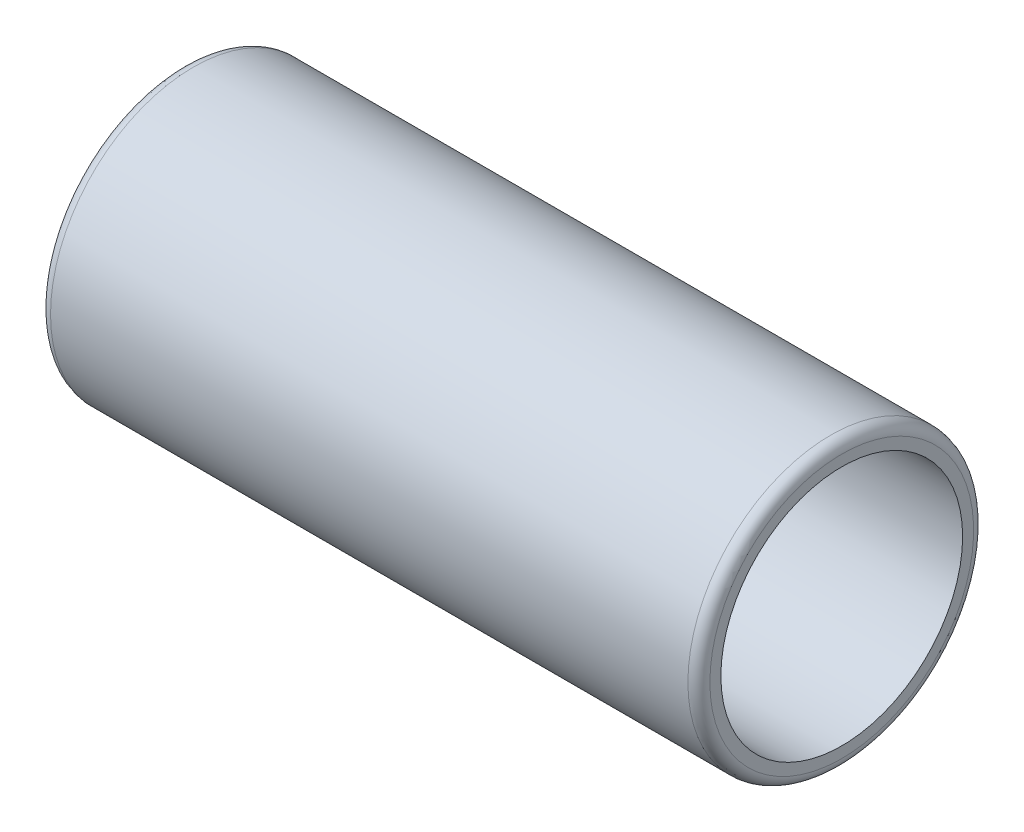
ISO-10303-21;
HEADER;
FILE_DESCRIPTION(('STEP AP214'),'2;1');
FILE_NAME('part.step','',(''),(''),'','','');
FILE_SCHEMA(('AUTOMOTIVE_DESIGN { 1 0 10303 214 1 1 1 1 }'));
ENDSEC;
DATA;
#1=APPLICATION_CONTEXT('core data for automotive mechanical design processes');
#2=APPLICATION_PROTOCOL_DEFINITION('international standard','automotive_design',2000,#1);
#3=PRODUCT_CONTEXT('',#1,'mechanical');
#4=PRODUCT('Part','Part','',(#3));
#5=PRODUCT_RELATED_PRODUCT_CATEGORY('part','',(#4));
#6=PRODUCT_DEFINITION_FORMATION('','',#4);
#7=PRODUCT_DEFINITION_CONTEXT('part definition',#1,'design');
#8=PRODUCT_DEFINITION('design','',#6,#7);
#9=PRODUCT_DEFINITION_SHAPE('','',#8);
#10=(LENGTH_UNIT() NAMED_UNIT(*) SI_UNIT(.MILLI.,.METRE.));
#11=(NAMED_UNIT(*) PLANE_ANGLE_UNIT() SI_UNIT($,.RADIAN.));
#12=(NAMED_UNIT(*) SI_UNIT($,.STERADIAN.) SOLID_ANGLE_UNIT());
#13=UNCERTAINTY_MEASURE_WITH_UNIT(LENGTH_MEASURE(1.E-05),#10,'distance_accuracy_value','');
#14=(GEOMETRIC_REPRESENTATION_CONTEXT(3) GLOBAL_UNCERTAINTY_ASSIGNED_CONTEXT((#13)) GLOBAL_UNIT_ASSIGNED_CONTEXT((#10,
#11,#12)) REPRESENTATION_CONTEXT('',''));
#15=CARTESIAN_POINT('',(0.,0.,0.));
#16=DIRECTION('',(0.,0.,1.));
#17=DIRECTION('',(1.,0.,0.));
#18=AXIS2_PLACEMENT_3D('',#15,#16,#17);
#19=CARTESIAN_POINT('',(0.,0.,0.));
#20=DIRECTION('',(-1.,0.,0.));
#21=DIRECTION('',(0.,0.,1.));
#22=AXIS2_PLACEMENT_3D('',#19,#20,#21);
#23=CYLINDRICAL_SURFACE('',#22,6.);
#24=CARTESIAN_POINT('',(8.,0.,0.));
#25=DIRECTION('',(-1.,0.,0.));
#26=DIRECTION('',(0.,0.,1.));
#27=AXIS2_PLACEMENT_3D('',#24,#25,#26);
#28=CIRCLE('',#27,6.);
#29=CARTESIAN_POINT('',(8.,0.,6.));
#30=VERTEX_POINT('',#29);
#31=EDGE_CURVE('E43',#30,#30,#28,.T.);
#32=ORIENTED_EDGE('',*,*,#31,.F.);
#33=EDGE_LOOP('',(#32));
#34=FACE_BOUND('',#33,.T.);
#35=CARTESIAN_POINT('',(0.,0.,0.));
#36=DIRECTION('',(-1.,0.,0.));
#37=DIRECTION('',(0.,0.,1.));
#38=AXIS2_PLACEMENT_3D('',#35,#36,#37);
#39=CIRCLE('',#38,6.);
#40=CARTESIAN_POINT('',(0.,0.,6.));
#41=VERTEX_POINT('',#40);
#42=EDGE_CURVE('E34',#41,#41,#39,.T.);
#43=ORIENTED_EDGE('',*,*,#42,.T.);
#44=EDGE_LOOP('',(#43));
#45=FACE_BOUND('',#44,.T.);
#46=ADVANCED_FACE('F14',(#34,#45),#23,.F.);
#47=CARTESIAN_POINT('',(0.,6.,0.));
#48=DIRECTION('',(1.,0.,0.));
#49=DIRECTION('',(0.,0.,-1.));
#50=AXIS2_PLACEMENT_3D('',#47,#48,#49);
#51=PLANE('',#50);
#52=CARTESIAN_POINT('',(0.,0.,0.));
#53=DIRECTION('',(1.,0.,0.));
#54=DIRECTION('',(0.,0.,-1.));
#55=AXIS2_PLACEMENT_3D('',#52,#53,#54);
#56=CIRCLE('',#55,12.);
#57=CARTESIAN_POINT('',(0.,0.,-12.));
#58=VERTEX_POINT('',#57);
#59=EDGE_CURVE('E21',#58,#58,#56,.F.);
#60=ORIENTED_EDGE('',*,*,#59,.T.);
#61=EDGE_LOOP('',(#60));
#62=FACE_BOUND('',#61,.T.);
#63=ORIENTED_EDGE('',*,*,#42,.F.);
#64=EDGE_LOOP('',(#63));
#65=FACE_BOUND('',#64,.T.);
#66=ADVANCED_FACE('F51',(#62,#65),#51,.F.);
#67=CARTESIAN_POINT('',(0.,0.,0.));
#68=DIRECTION('',(-1.,0.,0.));
#69=DIRECTION('',(0.,0.,1.));
#70=AXIS2_PLACEMENT_3D('',#67,#68,#69);
#71=CYLINDRICAL_SURFACE('',#70,13.);
#72=CARTESIAN_POINT('',(1.,0.,0.));
#73=DIRECTION('',(1.,0.,0.));
#74=DIRECTION('',(0.,0.,-1.));
#75=AXIS2_PLACEMENT_3D('',#72,#73,#74);
#76=CIRCLE('',#75,13.);
#77=CARTESIAN_POINT('',(1.,0.,-13.));
#78=VERTEX_POINT('',#77);
#79=EDGE_CURVE('E9',#78,#78,#76,.T.);
#80=ORIENTED_EDGE('',*,*,#79,.T.);
#81=EDGE_LOOP('',(#80));
#82=FACE_BOUND('',#81,.T.);
#83=CARTESIAN_POINT('',(59.,0.,0.));
#84=DIRECTION('',(-1.,0.,0.));
#85=DIRECTION('',(0.,0.,1.));
#86=AXIS2_PLACEMENT_3D('',#83,#84,#85);
#87=CIRCLE('',#86,13.);
#88=CARTESIAN_POINT('',(59.,0.,13.));
#89=VERTEX_POINT('',#88);
#90=EDGE_CURVE('E29',#89,#89,#87,.T.);
#91=ORIENTED_EDGE('',*,*,#90,.T.);
#92=EDGE_LOOP('',(#91));
#93=FACE_BOUND('',#92,.T.);
#94=ADVANCED_FACE('F56',(#82,#93),#71,.T.);
#95=CARTESIAN_POINT('',(60.,13.,0.));
#96=DIRECTION('',(-1.,0.,0.));
#97=DIRECTION('',(0.,0.,1.));
#98=AXIS2_PLACEMENT_3D('',#95,#96,#97);
#99=PLANE('',#98);
#100=CARTESIAN_POINT('',(60.,0.,0.));
#101=DIRECTION('',(-1.,0.,0.));
#102=DIRECTION('',(0.,0.,1.));
#103=AXIS2_PLACEMENT_3D('',#100,#101,#102);
#104=CIRCLE('',#103,12.);
#105=CARTESIAN_POINT('',(60.,0.,12.));
#106=VERTEX_POINT('',#105);
#107=EDGE_CURVE('E25',#106,#106,#104,.F.);
#108=ORIENTED_EDGE('',*,*,#107,.T.);
#109=EDGE_LOOP('',(#108));
#110=FACE_BOUND('',#109,.T.);
#111=CARTESIAN_POINT('',(60.,0.,0.));
#112=DIRECTION('',(-1.,0.,0.));
#113=DIRECTION('',(0.,0.,1.));
#114=AXIS2_PLACEMENT_3D('',#111,#112,#113);
#115=CIRCLE('',#114,11.);
#116=CARTESIAN_POINT('',(60.,0.,11.));
#117=VERTEX_POINT('',#116);
#118=EDGE_CURVE('E37',#117,#117,#115,.T.);
#119=ORIENTED_EDGE('',*,*,#118,.T.);
#120=EDGE_LOOP('',(#119));
#121=FACE_BOUND('',#120,.T.);
#122=ADVANCED_FACE('F63',(#110,#121),#99,.F.);
#123=CARTESIAN_POINT('',(0.,0.,0.));
#124=DIRECTION('',(-1.,0.,0.));
#125=DIRECTION('',(0.,0.,1.));
#126=AXIS2_PLACEMENT_3D('',#123,#124,#125);
#127=CYLINDRICAL_SURFACE('',#126,11.);
#128=ORIENTED_EDGE('',*,*,#118,.F.);
#129=EDGE_LOOP('',(#128));
#130=FACE_BOUND('',#129,.T.);
#131=CARTESIAN_POINT('',(13.,0.,0.));
#132=DIRECTION('',(-1.,0.,0.));
#133=DIRECTION('',(0.,0.,1.));
#134=AXIS2_PLACEMENT_3D('',#131,#132,#133);
#135=CIRCLE('',#134,11.);
#136=CARTESIAN_POINT('',(13.,0.,11.));
#137=VERTEX_POINT('',#136);
#138=EDGE_CURVE('E40',#137,#137,#135,.T.);
#139=ORIENTED_EDGE('',*,*,#138,.T.);
#140=EDGE_LOOP('',(#139));
#141=FACE_BOUND('',#140,.T.);
#142=ADVANCED_FACE('F75',(#130,#141),#127,.F.);
#143=CARTESIAN_POINT('',(8.,0.,0.));
#144=DIRECTION('',(1.,0.,0.));
#145=DIRECTION('',(0.,0.,-1.));
#146=AXIS2_PLACEMENT_3D('',#143,#144,#145);
#147=CONICAL_SURFACE('',#146,6.,0.785398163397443);
#148=ORIENTED_EDGE('',*,*,#138,.F.);
#149=EDGE_LOOP('',(#148));
#150=FACE_BOUND('',#149,.T.);
#151=ORIENTED_EDGE('',*,*,#31,.T.);
#152=EDGE_LOOP('',(#151));
#153=FACE_BOUND('',#152,.T.);
#154=ADVANCED_FACE('F47',(#150,#153),#147,.F.);
#155=CARTESIAN_POINT('',(59.,0.,0.));
#156=DIRECTION('',(-1.,0.,0.));
#157=DIRECTION('',(0.,0.,1.));
#158=AXIS2_PLACEMENT_3D('',#155,#156,#157);
#159=TOROIDAL_SURFACE('',#158,12.,1.);
#160=ORIENTED_EDGE('',*,*,#107,.F.);
#161=EDGE_LOOP('',(#160));
#162=FACE_BOUND('',#161,.T.);
#163=ORIENTED_EDGE('',*,*,#90,.F.);
#164=EDGE_LOOP('',(#163));
#165=FACE_BOUND('',#164,.T.);
#166=ADVANCED_FACE('F66',(#162,#165),#159,.T.);
#167=CARTESIAN_POINT('',(1.,0.,0.));
#168=DIRECTION('',(1.,0.,0.));
#169=DIRECTION('',(0.,0.,-1.));
#170=AXIS2_PLACEMENT_3D('',#167,#168,#169);
#171=TOROIDAL_SURFACE('',#170,12.,1.);
#172=ORIENTED_EDGE('',*,*,#79,.F.);
#173=EDGE_LOOP('',(#172));
#174=FACE_BOUND('',#173,.T.);
#175=ORIENTED_EDGE('',*,*,#59,.F.);
#176=EDGE_LOOP('',(#175));
#177=FACE_BOUND('',#176,.T.);
#178=ADVANCED_FACE('F16',(#174,#177),#171,.T.);
#179=CLOSED_SHELL('',(#46,#66,#94,#122,#142,#154,#166,#178));
#180=MANIFOLD_SOLID_BREP('B1',#179);
#181=ADVANCED_BREP_SHAPE_REPRESENTATION('',(#18,#180),#14);
#182=SHAPE_DEFINITION_REPRESENTATION(#9,#181);
ENDSEC;
END-ISO-10303-21;
